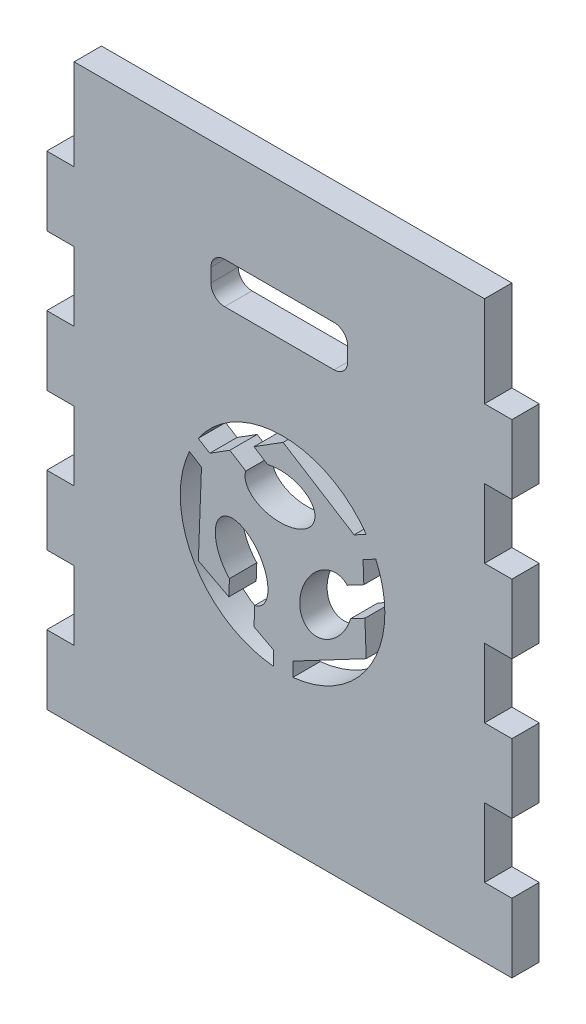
from build123d import *

# Parameters (mm, degrees)
EXTRUDE1_DEPTH = 20
EXTRUDE2_DEPTH = 576.943885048
EXTRUDE3_DEPTH = 576.943885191


with BuildPart() as part:
    # Sketch1 → Extrude1 (new body)
    with BuildSketch(Plane.XY):
        Polygon((-3.168, 46.75), (16.832, 46.75), (316.832, 46.75), (336.832, 46.75), (336.832, 97.25), (316.832, 97.25), (316.832, 147.75), (336.832, 147.75), (336.832, 198.25), (316.832, 198.25), (316.832, 248.75), (336.832, 248.75), (336.832, 299.25), (316.832, 299.25), (316.832, 349.75), (336.832, 349.75), (336.832, 400.25), (316.832, 400.25), (316.832, 466.75), (16.832, 466.75), (16.832, 400.25), (-3.168, 400.25), (-3.168, 349.75), (16.832, 349.75), (16.832, 299.25), (-3.168, 299.25), (-3.168, 248.75), (16.832, 248.75), (16.832, 198.25), (-3.168, 198.25), (-3.168, 147.75), (16.832, 147.75), (16.832, 97.25), (-3.168, 97.25), align=None)
    extrude(amount=EXTRUDE1_DEPTH)

    # Sketch2 → Extrude2 (cut, through all)
    with BuildSketch(Plane.XY.offset(20)):
        with BuildLine():
            Line((229.395063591, 220.797620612), (230.341916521, 195.634525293))
            Line((230.341916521, 195.634525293), (176.734635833, 167.316717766))
            Line((176.734635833, 167.316717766), (176.734635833, 157.004588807))
            ThreePointArc((176.734635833, 157.004588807), (233.98023988, 194.057593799), (237.346932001, 262.165227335))
            Line((237.346932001, 262.165227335), (228.023774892, 257.24031107))
            Line((228.023774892, 257.24031107), (228.612342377, 241.598832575))
            Line((228.612342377, 241.598832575), (216.437455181, 235.167502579))
            add(Edge.make_bspline(
                [(216.437455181, 235.167502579), (202.600746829, 250.478058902), (186.839618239, 223.865205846), (171.078489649, 197.252352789), (190.848526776, 191.960292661), (210.618563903, 186.668232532), (218.937196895, 215.273299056)],
                knots=[2.935135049, 2.935135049, 2.935135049, 4.695287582, 4.695287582, 6.455440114, 6.455440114, 8.215592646, 8.215592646, 8.215592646], degree=2, weights=[1, 0.637092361, 1, 0.637092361, 1, 0.637092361, 1]))
            Line((218.937196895, 215.273299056), (229.395063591, 220.797620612))
        make_face()
        with BuildLine():
            Line((148.277993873, 288.829258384), (169.596447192, 302.230804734))
            Line((169.596447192, 302.230804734), (221.490332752, 269.60844221))
            Line((221.490332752, 269.60844221), (230.41986604, 274.325428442))
            ThreePointArc((230.41986604, 274.325428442), (168.851492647, 306.169370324), (107.580452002, 273.757014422))
            Line((107.580452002, 273.757014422), (115.941168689, 268.501167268))
            Line((115.941168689, 268.501167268), (130.65497649, 277.750795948))
            Line((130.65497649, 277.750795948), (142.312115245, 270.422699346))
            add(Edge.make_bspline(
                [(142.312115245, 270.422699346), (135.971138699, 250.784480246), (166.899109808, 250.441369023), (197.827080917, 250.0982578), (192.525120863, 269.86564225), (187.223160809, 289.6330267), (158.291130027, 282.534640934)],
                knots=[2.935135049, 2.935135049, 2.935135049, 4.695287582, 4.695287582, 6.455440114, 6.455440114, 8.215592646, 8.215592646, 8.215592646], degree=2, weights=[1, 0.637092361, 1, 0.637092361, 1, 0.637092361, 1]))
            Line((158.291130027, 282.534640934), (148.277993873, 288.829258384))
        make_face()
        with BuildLine():
            Line((101.090384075, 262.25884239), (109.926070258, 256.704412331))
            Line((109.926070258, 256.704412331), (107.654095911, 196.32554541))
            Line((107.654095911, 196.32554541), (129.91940216, 184.563996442))
            Line((129.91940216, 184.563996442), (130.364132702, 196.382935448))
            add(Edge.make_bspline(
                [(148.842889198, 188.600673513), (169.020574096, 192.928336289), (153.853731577, 219.884300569), (138.686889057, 246.840264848), (124.218811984, 232.364940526), (109.750734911, 217.889616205), (130.364132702, 196.382935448)],
                knots=[6.076727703, 6.076727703, 6.076727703, 7.836880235, 7.836880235, 9.597032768, 9.597032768, 11.3571853, 11.3571853, 11.3571853], degree=2, weights=[1, 0.637092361, 1, 0.637092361, 1, 0.637092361, 1]))
            Line((148.842889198, 188.600673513), (148.325140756, 174.841246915))
            Line((148.325140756, 174.841246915), (162.484487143, 167.36163518))
            Line((162.484487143, 167.36163518), (162.484487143, 156.925696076))
            ThreePointArc((162.484487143, 156.925696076), (104.596559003, 193.743891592), (101.090384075, 262.25884239))
        make_face()
    extrude(amount=-EXTRUDE2_DEPTH, mode=Mode.SUBTRACT)

    # Sketch3 → Extrude3 (cut, through all)
    with BuildSketch(Plane.XY.offset(20)):
        with BuildLine():
            Line((126.832, 396.75), (206.832, 396.75))
            ThreePointArc((206.832, 396.75), (213.903067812, 393.821067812), (216.832, 386.75))
            Line((216.832, 386.75), (216.832, 376.75))
            ThreePointArc((216.832, 376.75), (213.903067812, 369.678932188), (206.832, 366.75))
            Line((206.832, 366.75), (126.832, 366.75))
            ThreePointArc((126.832, 366.75), (119.760932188, 369.678932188), (116.832, 376.75))
            Line((116.832, 376.75), (116.832, 386.75))
            ThreePointArc((116.832, 386.75), (119.760932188, 393.821067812), (126.832, 396.75))
        make_face()
    extrude(amount=-EXTRUDE3_DEPTH, mode=Mode.SUBTRACT)


solid = part.part
